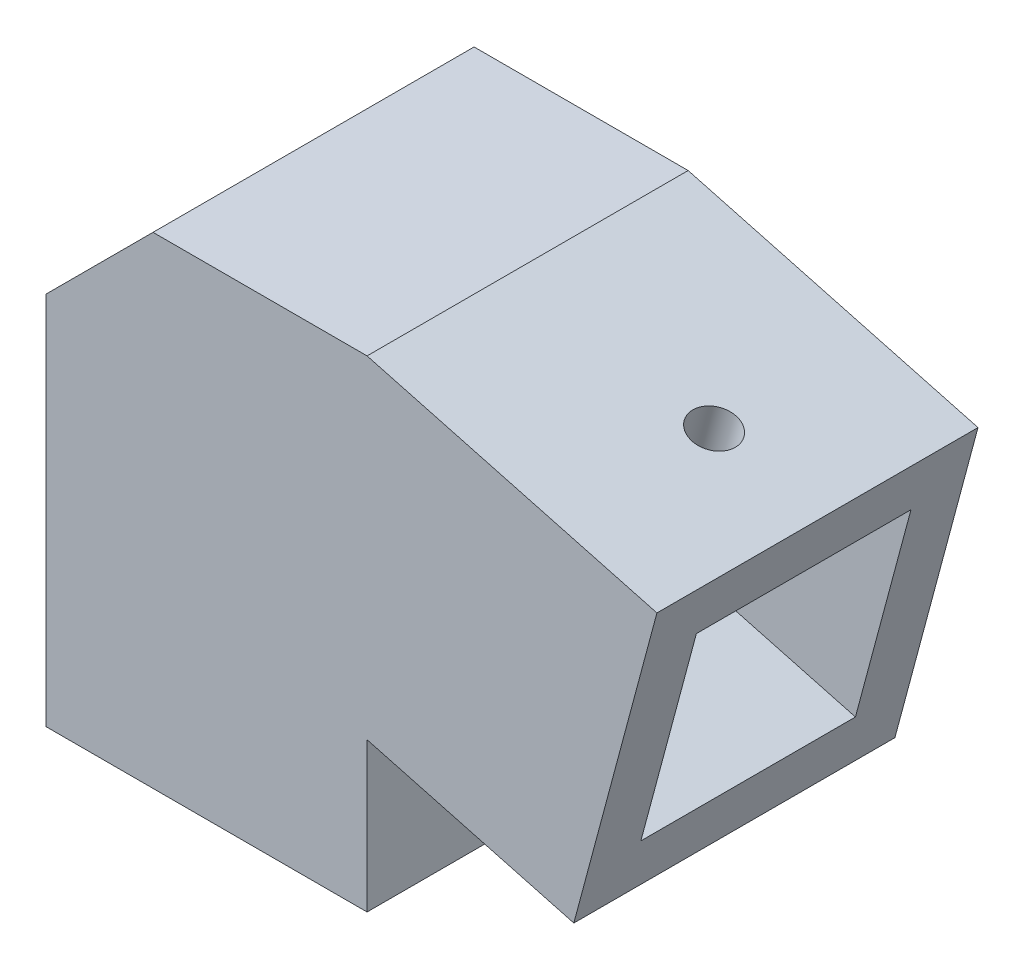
ISO-10303-21;
HEADER;
FILE_DESCRIPTION(('STEP AP214'),'2;1');
FILE_NAME('part.step','',(''),(''),'','','');
FILE_SCHEMA(('AUTOMOTIVE_DESIGN { 1 0 10303 214 1 1 1 1 }'));
ENDSEC;
DATA;
#1=APPLICATION_CONTEXT('core data for automotive mechanical design processes');
#2=APPLICATION_PROTOCOL_DEFINITION('international standard','automotive_design',2000,#1);
#3=PRODUCT_CONTEXT('',#1,'mechanical');
#4=PRODUCT('Part','Part','',(#3));
#5=PRODUCT_RELATED_PRODUCT_CATEGORY('part','',(#4));
#6=PRODUCT_DEFINITION_FORMATION('','',#4);
#7=PRODUCT_DEFINITION_CONTEXT('part definition',#1,'design');
#8=PRODUCT_DEFINITION('design','',#6,#7);
#9=PRODUCT_DEFINITION_SHAPE('','',#8);
#10=(LENGTH_UNIT() NAMED_UNIT(*) SI_UNIT(.MILLI.,.METRE.));
#11=(NAMED_UNIT(*) PLANE_ANGLE_UNIT() SI_UNIT($,.RADIAN.));
#12=(NAMED_UNIT(*) SI_UNIT($,.STERADIAN.) SOLID_ANGLE_UNIT());
#13=UNCERTAINTY_MEASURE_WITH_UNIT(LENGTH_MEASURE(1.E-05),#10,'distance_accuracy_value','');
#14=(GEOMETRIC_REPRESENTATION_CONTEXT(3) GLOBAL_UNCERTAINTY_ASSIGNED_CONTEXT((#13)) GLOBAL_UNIT_ASSIGNED_CONTEXT((#10,
#11,#12)) REPRESENTATION_CONTEXT('',''));
#15=CARTESIAN_POINT('',(0.,0.,0.));
#16=DIRECTION('',(0.,0.,1.));
#17=DIRECTION('',(1.,0.,0.));
#18=AXIS2_PLACEMENT_3D('',#15,#16,#17);
#19=CARTESIAN_POINT('',(15.,-25.,15.));
#20=DIRECTION('',(1.,0.,0.));
#21=DIRECTION('',(0.,0.,-1.));
#22=AXIS2_PLACEMENT_3D('',#19,#20,#21);
#23=PLANE('',#22);
#24=DIRECTION('',(0.,1.,0.));
#25=VECTOR('',#24,1.);
#26=CARTESIAN_POINT('',(15.,-25.,-15.));
#27=LINE('',#26,#25);
#28=CARTESIAN_POINT('',(15.,-25.,-15.));
#29=VERTEX_POINT('',#28);
#30=CARTESIAN_POINT('',(15.,-11.0582854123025,-15.));
#31=VERTEX_POINT('',#30);
#32=EDGE_CURVE('E321',#29,#31,#27,.T.);
#33=ORIENTED_EDGE('',*,*,#32,.T.);
#34=DIRECTION('',(0.,0.,1.));
#35=VECTOR('',#34,1.);
#36=CARTESIAN_POINT('',(15.,-11.0582854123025,-60.2376468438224));
#37=LINE('',#36,#35);
#38=CARTESIAN_POINT('',(15.,-11.0582854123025,15.));
#39=VERTEX_POINT('',#38);
#40=EDGE_CURVE('E284',#31,#39,#37,.T.);
#41=ORIENTED_EDGE('',*,*,#40,.T.);
#42=DIRECTION('',(0.,1.,0.));
#43=VECTOR('',#42,1.);
#44=CARTESIAN_POINT('',(15.,-25.,15.));
#45=LINE('',#44,#43);
#46=CARTESIAN_POINT('',(15.,-25.,15.));
#47=VERTEX_POINT('',#46);
#48=EDGE_CURVE('E325',#47,#39,#45,.T.);
#49=ORIENTED_EDGE('',*,*,#48,.F.);
#50=DIRECTION('',(0.,0.,-1.));
#51=VECTOR('',#50,1.);
#52=CARTESIAN_POINT('',(15.,-25.,15.));
#53=LINE('',#52,#51);
#54=EDGE_CURVE('E304',#47,#29,#53,.T.);
#55=ORIENTED_EDGE('',*,*,#54,.T.);
#56=EDGE_LOOP('',(#33,#41,#49,#55));
#57=FACE_BOUND('',#56,.T.);
#58=ADVANCED_FACE('F50',(#57),#23,.T.);
#59=CARTESIAN_POINT('',(-15.,-25.,15.));
#60=DIRECTION('',(0.,0.,1.));
#61=DIRECTION('',(1.,0.,0.));
#62=AXIS2_PLACEMENT_3D('',#59,#60,#61);
#63=PLANE('',#62);
#64=DIRECTION('',(1.,0.,0.));
#65=VECTOR('',#64,1.);
#66=CARTESIAN_POINT('',(-15.,20.,15.));
#67=LINE('',#66,#65);
#68=CARTESIAN_POINT('',(-4.99999999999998,20.,15.));
#69=VERTEX_POINT('',#68);
#70=CARTESIAN_POINT('',(15.,20.,15.));
#71=VERTEX_POINT('',#70);
#72=EDGE_CURVE('E305',#69,#71,#67,.T.);
#73=ORIENTED_EDGE('',*,*,#72,.F.);
#74=DIRECTION('',(-0.707106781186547,-0.707106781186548,0.));
#75=VECTOR('',#74,1.);
#76=CARTESIAN_POINT('',(-32.5,-7.50000000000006,15.));
#77=LINE('',#76,#75);
#78=CARTESIAN_POINT('',(-15.,9.99999999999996,15.));
#79=VERTEX_POINT('',#78);
#80=EDGE_CURVE('E71',#69,#79,#77,.T.);
#81=ORIENTED_EDGE('',*,*,#80,.T.);
#82=DIRECTION('',(0.,1.,0.));
#83=VECTOR('',#82,1.);
#84=CARTESIAN_POINT('',(-15.,-25.,15.));
#85=LINE('',#84,#83);
#86=CARTESIAN_POINT('',(-15.,-25.,15.));
#87=VERTEX_POINT('',#86);
#88=EDGE_CURVE('E326',#87,#79,#85,.T.);
#89=ORIENTED_EDGE('',*,*,#88,.F.);
#90=DIRECTION('',(1.,0.,0.));
#91=VECTOR('',#90,1.);
#92=CARTESIAN_POINT('',(-15.,-25.,15.));
#93=LINE('',#92,#91);
#94=EDGE_CURVE('E320',#87,#47,#93,.T.);
#95=ORIENTED_EDGE('',*,*,#94,.T.);
#96=ORIENTED_EDGE('',*,*,#48,.T.);
#97=DIRECTION('',(0.965925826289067,-0.258819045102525,0.));
#98=VECTOR('',#97,1.);
#99=CARTESIAN_POINT('',(15.,-11.0582854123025,15.));
#100=LINE('',#99,#98);
#101=CARTESIAN_POINT('',(34.3185165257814,-16.234666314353,15.));
#102=VERTEX_POINT('',#101);
#103=EDGE_CURVE('E255',#39,#102,#100,.T.);
#104=ORIENTED_EDGE('',*,*,#103,.T.);
#105=DIRECTION('',(0.258819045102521,0.965925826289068,0.));
#106=VECTOR('',#105,1.);
#107=CARTESIAN_POINT('',(34.3185165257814,-16.234666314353,15.));
#108=LINE('',#107,#106);
#109=CARTESIAN_POINT('',(42.083087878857,12.743108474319,15.));
#110=VERTEX_POINT('',#109);
#111=EDGE_CURVE('E270',#102,#110,#108,.T.);
#112=ORIENTED_EDGE('',*,*,#111,.T.);
#113=DIRECTION('',(-0.965925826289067,0.258819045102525,0.));
#114=VECTOR('',#113,1.);
#115=CARTESIAN_POINT('',(15.,20.,15.));
#116=LINE('',#115,#114);
#117=EDGE_CURVE('E261',#110,#71,#116,.T.);
#118=ORIENTED_EDGE('',*,*,#117,.T.);
#119=EDGE_LOOP('',(#73,#81,#89,#95,#96,#104,#112,#118));
#120=FACE_BOUND('',#119,.T.);
#121=ADVANCED_FACE('F350',(#120),#63,.T.);
#122=CARTESIAN_POINT('',(-15.,-25.,15.));
#123=DIRECTION('',(-1.,0.,0.));
#124=DIRECTION('',(0.,0.,1.));
#125=AXIS2_PLACEMENT_3D('',#122,#123,#124);
#126=PLANE('',#125);
#127=CARTESIAN_POINT('',(-15.,-15.,0.));
#128=DIRECTION('',(-1.,0.,0.));
#129=DIRECTION('',(0.,0.,1.));
#130=AXIS2_PLACEMENT_3D('',#127,#128,#129);
#131=CIRCLE('',#130,2.05);
#132=CARTESIAN_POINT('',(-15.,-15.,2.05));
#133=VERTEX_POINT('',#132);
#134=EDGE_CURVE('E437',#133,#133,#131,.T.);
#135=ORIENTED_EDGE('',*,*,#134,.F.);
#136=EDGE_LOOP('',(#135));
#137=FACE_BOUND('',#136,.T.);
#138=ORIENTED_EDGE('',*,*,#88,.T.);
#139=DIRECTION('',(0.,0.,-1.));
#140=VECTOR('',#139,1.);
#141=CARTESIAN_POINT('',(-15.,9.99999999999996,-15.));
#142=LINE('',#141,#140);
#143=CARTESIAN_POINT('',(-15.,9.99999999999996,-15.));
#144=VERTEX_POINT('',#143);
#145=EDGE_CURVE('E60',#79,#144,#142,.T.);
#146=ORIENTED_EDGE('',*,*,#145,.T.);
#147=DIRECTION('',(0.,1.,0.));
#148=VECTOR('',#147,1.);
#149=CARTESIAN_POINT('',(-15.,-25.,-15.));
#150=LINE('',#149,#148);
#151=CARTESIAN_POINT('',(-15.,-25.,-15.));
#152=VERTEX_POINT('',#151);
#153=EDGE_CURVE('E327',#152,#144,#150,.T.);
#154=ORIENTED_EDGE('',*,*,#153,.F.);
#155=DIRECTION('',(0.,0.,1.));
#156=VECTOR('',#155,1.);
#157=CARTESIAN_POINT('',(-15.,-25.,15.));
#158=LINE('',#157,#156);
#159=EDGE_CURVE('E312',#152,#87,#158,.T.);
#160=ORIENTED_EDGE('',*,*,#159,.T.);
#161=EDGE_LOOP('',(#138,#146,#154,#160));
#162=FACE_BOUND('',#161,.T.);
#163=ADVANCED_FACE('F372',(#137,#162),#126,.T.);
#164=CARTESIAN_POINT('',(-15.,-25.,-15.));
#165=DIRECTION('',(0.,0.,-1.));
#166=DIRECTION('',(-1.,0.,0.));
#167=AXIS2_PLACEMENT_3D('',#164,#165,#166);
#168=PLANE('',#167);
#169=ORIENTED_EDGE('',*,*,#153,.T.);
#170=DIRECTION('',(0.707106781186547,0.707106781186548,0.));
#171=VECTOR('',#170,1.);
#172=CARTESIAN_POINT('',(-32.5,-7.50000000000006,-15.));
#173=LINE('',#172,#171);
#174=CARTESIAN_POINT('',(-4.99999999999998,20.,-15.));
#175=VERTEX_POINT('',#174);
#176=EDGE_CURVE('E11',#144,#175,#173,.T.);
#177=ORIENTED_EDGE('',*,*,#176,.T.);
#178=DIRECTION('',(-1.,0.,0.));
#179=VECTOR('',#178,1.);
#180=CARTESIAN_POINT('',(-15.,20.,-15.));
#181=LINE('',#180,#179);
#182=CARTESIAN_POINT('',(15.,20.,-15.));
#183=VERTEX_POINT('',#182);
#184=EDGE_CURVE('E296',#183,#175,#181,.T.);
#185=ORIENTED_EDGE('',*,*,#184,.F.);
#186=DIRECTION('',(-0.965925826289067,0.258819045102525,0.));
#187=VECTOR('',#186,1.);
#188=CARTESIAN_POINT('',(15.,20.,-15.));
#189=LINE('',#188,#187);
#190=CARTESIAN_POINT('',(42.083087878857,12.743108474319,-15.));
#191=VERTEX_POINT('',#190);
#192=EDGE_CURVE('E277',#191,#183,#189,.T.);
#193=ORIENTED_EDGE('',*,*,#192,.F.);
#194=DIRECTION('',(0.258819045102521,0.965925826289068,0.));
#195=VECTOR('',#194,1.);
#196=CARTESIAN_POINT('',(34.3185165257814,-16.234666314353,-15.));
#197=LINE('',#196,#195);
#198=CARTESIAN_POINT('',(34.3185165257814,-16.234666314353,-15.));
#199=VERTEX_POINT('',#198);
#200=EDGE_CURVE('E285',#199,#191,#197,.T.);
#201=ORIENTED_EDGE('',*,*,#200,.F.);
#202=DIRECTION('',(0.965925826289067,-0.258819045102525,0.));
#203=VECTOR('',#202,1.);
#204=CARTESIAN_POINT('',(15.,-11.0582854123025,-15.));
#205=LINE('',#204,#203);
#206=EDGE_CURVE('E266',#31,#199,#205,.T.);
#207=ORIENTED_EDGE('',*,*,#206,.F.);
#208=ORIENTED_EDGE('',*,*,#32,.F.);
#209=DIRECTION('',(-1.,0.,0.));
#210=VECTOR('',#209,1.);
#211=CARTESIAN_POINT('',(-15.,-25.,-15.));
#212=LINE('',#211,#210);
#213=EDGE_CURVE('E307',#29,#152,#212,.T.);
#214=ORIENTED_EDGE('',*,*,#213,.T.);
#215=EDGE_LOOP('',(#169,#177,#185,#193,#201,#207,#208,#214));
#216=FACE_BOUND('',#215,.T.);
#217=ADVANCED_FACE('F354',(#216),#168,.T.);
#218=CARTESIAN_POINT('',(0.,-25.,0.));
#219=DIRECTION('',(0.,-1.,0.));
#220=DIRECTION('',(0.,0.,-1.));
#221=AXIS2_PLACEMENT_3D('',#218,#219,#220);
#222=PLANE('',#221);
#223=DIRECTION('',(0.,0.,1.));
#224=VECTOR('',#223,1.);
#225=CARTESIAN_POINT('',(10.025,-25.,-10.025));
#226=LINE('',#225,#224);
#227=CARTESIAN_POINT('',(10.025,-25.,-10.025));
#228=VERTEX_POINT('',#227);
#229=CARTESIAN_POINT('',(10.025,-25.,10.025));
#230=VERTEX_POINT('',#229);
#231=EDGE_CURVE('E215',#228,#230,#226,.T.);
#232=ORIENTED_EDGE('',*,*,#231,.F.);
#233=DIRECTION('',(1.,0.,0.));
#234=VECTOR('',#233,1.);
#235=CARTESIAN_POINT('',(-10.025,-25.,-10.025));
#236=LINE('',#235,#234);
#237=CARTESIAN_POINT('',(-10.025,-25.,-10.025));
#238=VERTEX_POINT('',#237);
#239=EDGE_CURVE('E222',#238,#228,#236,.T.);
#240=ORIENTED_EDGE('',*,*,#239,.F.);
#241=DIRECTION('',(0.,0.,-1.));
#242=VECTOR('',#241,1.);
#243=CARTESIAN_POINT('',(-10.025,-25.,-10.025));
#244=LINE('',#243,#242);
#245=CARTESIAN_POINT('',(-10.025,-25.,10.025));
#246=VERTEX_POINT('',#245);
#247=EDGE_CURVE('E245',#246,#238,#244,.T.);
#248=ORIENTED_EDGE('',*,*,#247,.F.);
#249=DIRECTION('',(-1.,0.,0.));
#250=VECTOR('',#249,1.);
#251=CARTESIAN_POINT('',(-10.025,-25.,10.025));
#252=LINE('',#251,#250);
#253=EDGE_CURVE('E238',#230,#246,#252,.T.);
#254=ORIENTED_EDGE('',*,*,#253,.F.);
#255=EDGE_LOOP('',(#232,#240,#248,#254));
#256=FACE_BOUND('',#255,.T.);
#257=ORIENTED_EDGE('',*,*,#54,.F.);
#258=ORIENTED_EDGE('',*,*,#94,.F.);
#259=ORIENTED_EDGE('',*,*,#159,.F.);
#260=ORIENTED_EDGE('',*,*,#213,.F.);
#261=EDGE_LOOP('',(#257,#258,#259,#260));
#262=FACE_BOUND('',#261,.T.);
#263=ADVANCED_FACE('F378',(#256,#262),#222,.T.);
#264=CARTESIAN_POINT('',(0.,20.,0.));
#265=DIRECTION('',(0.,-1.,0.));
#266=DIRECTION('',(0.,0.,-1.));
#267=AXIS2_PLACEMENT_3D('',#264,#265,#266);
#268=PLANE('',#267);
#269=ORIENTED_EDGE('',*,*,#184,.T.);
#270=DIRECTION('',(0.,0.,1.));
#271=VECTOR('',#270,1.);
#272=CARTESIAN_POINT('',(-4.99999999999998,20.,15.));
#273=LINE('',#272,#271);
#274=EDGE_CURVE('E329',#175,#69,#273,.T.);
#275=ORIENTED_EDGE('',*,*,#274,.T.);
#276=ORIENTED_EDGE('',*,*,#72,.T.);
#277=DIRECTION('',(0.,0.,-1.));
#278=VECTOR('',#277,1.);
#279=CARTESIAN_POINT('',(15.,20.,15.));
#280=LINE('',#279,#278);
#281=EDGE_CURVE('E295',#71,#183,#280,.T.);
#282=ORIENTED_EDGE('',*,*,#281,.T.);
#283=EDGE_LOOP('',(#269,#275,#276,#282));
#284=FACE_BOUND('',#283,.T.);
#285=ADVANCED_FACE('F342',(#284),#268,.F.);
#286=CARTESIAN_POINT('',(15.,-11.0582854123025,-60.2376468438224));
#287=DIRECTION('',(-0.258819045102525,-0.965925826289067,0.));
#288=DIRECTION('',(0.965925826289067,-0.258819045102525,0.));
#289=AXIS2_PLACEMENT_3D('',#286,#287,#288);
#290=PLANE('',#289);
#291=ORIENTED_EDGE('',*,*,#40,.F.);
#292=ORIENTED_EDGE('',*,*,#206,.T.);
#293=DIRECTION('',(0.,0.,1.));
#294=VECTOR('',#293,1.);
#295=CARTESIAN_POINT('',(34.3185165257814,-16.234666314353,-60.2376468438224));
#296=LINE('',#295,#294);
#297=EDGE_CURVE('E280',#199,#102,#296,.T.);
#298=ORIENTED_EDGE('',*,*,#297,.T.);
#299=ORIENTED_EDGE('',*,*,#103,.F.);
#300=EDGE_LOOP('',(#291,#292,#298,#299));
#301=FACE_BOUND('',#300,.T.);
#302=ADVANCED_FACE('F390',(#301),#290,.T.);
#303=CARTESIAN_POINT('',(34.3185165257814,-16.234666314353,-60.2376468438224));
#304=DIRECTION('',(0.965925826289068,-0.258819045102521,0.));
#305=DIRECTION('',(0.258819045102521,0.965925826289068,0.));
#306=AXIS2_PLACEMENT_3D('',#303,#304,#305);
#307=PLANE('',#306);
#308=DIRECTION('',(0.258819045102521,0.965925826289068,0.));
#309=VECTOR('',#308,1.);
#310=CARTESIAN_POINT('',(35.6061412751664,-11.4291853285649,-10.025));
#311=LINE('',#310,#309);
#312=CARTESIAN_POINT('',(35.6061412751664,-11.4291853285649,-10.025));
#313=VERTEX_POINT('',#312);
#314=CARTESIAN_POINT('',(40.7954631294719,7.93762748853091,-10.025));
#315=VERTEX_POINT('',#314);
#316=EDGE_CURVE('E170',#313,#315,#311,.T.);
#317=ORIENTED_EDGE('',*,*,#316,.F.);
#318=DIRECTION('',(0.,0.,-1.));
#319=VECTOR('',#318,1.);
#320=CARTESIAN_POINT('',(35.6061412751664,-11.4291853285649,10.025));
#321=LINE('',#320,#319);
#322=CARTESIAN_POINT('',(35.6061412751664,-11.4291853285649,10.025));
#323=VERTEX_POINT('',#322);
#324=EDGE_CURVE('E190',#323,#313,#321,.T.);
#325=ORIENTED_EDGE('',*,*,#324,.F.);
#326=DIRECTION('',(-0.258819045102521,-0.965925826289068,0.));
#327=VECTOR('',#326,1.);
#328=CARTESIAN_POINT('',(35.6061412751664,-11.4291853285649,10.025));
#329=LINE('',#328,#327);
#330=CARTESIAN_POINT('',(40.795463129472,7.93762748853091,10.025));
#331=VERTEX_POINT('',#330);
#332=EDGE_CURVE('E191',#331,#323,#329,.T.);
#333=ORIENTED_EDGE('',*,*,#332,.F.);
#334=DIRECTION('',(0.,0.,1.));
#335=VECTOR('',#334,1.);
#336=CARTESIAN_POINT('',(40.795463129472,7.93762748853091,10.025));
#337=LINE('',#336,#335);
#338=EDGE_CURVE('E202',#315,#331,#337,.T.);
#339=ORIENTED_EDGE('',*,*,#338,.F.);
#340=EDGE_LOOP('',(#317,#325,#333,#339));
#341=FACE_BOUND('',#340,.T.);
#342=ORIENTED_EDGE('',*,*,#297,.F.);
#343=ORIENTED_EDGE('',*,*,#200,.T.);
#344=DIRECTION('',(0.,0.,1.));
#345=VECTOR('',#344,1.);
#346=CARTESIAN_POINT('',(42.083087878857,12.743108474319,-60.2376468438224));
#347=LINE('',#346,#345);
#348=EDGE_CURVE('E281',#191,#110,#347,.T.);
#349=ORIENTED_EDGE('',*,*,#348,.T.);
#350=ORIENTED_EDGE('',*,*,#111,.F.);
#351=EDGE_LOOP('',(#342,#343,#349,#350));
#352=FACE_BOUND('',#351,.T.);
#353=ADVANCED_FACE('F388',(#341,#352),#307,.T.);
#354=CARTESIAN_POINT('',(15.,20.,-60.2376468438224));
#355=DIRECTION('',(0.258819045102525,0.965925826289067,0.));
#356=DIRECTION('',(-0.965925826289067,0.258819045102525,0.));
#357=AXIS2_PLACEMENT_3D('',#354,#355,#356);
#358=PLANE('',#357);
#359=CARTESIAN_POINT('',(32.4238296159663,15.3312989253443,0.));
#360=DIRECTION('',(0.258819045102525,0.965925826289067,0.));
#361=DIRECTION('',(-0.965925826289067,0.258819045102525,0.));
#362=AXIS2_PLACEMENT_3D('',#359,#360,#361);
#363=CIRCLE('',#362,2.05);
#364=CARTESIAN_POINT('',(30.4436816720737,15.8618779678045,0.));
#365=VERTEX_POINT('',#364);
#366=EDGE_CURVE('E442',#365,#365,#363,.T.);
#367=ORIENTED_EDGE('',*,*,#366,.F.);
#368=EDGE_LOOP('',(#367));
#369=FACE_BOUND('',#368,.T.);
#370=ORIENTED_EDGE('',*,*,#348,.F.);
#371=ORIENTED_EDGE('',*,*,#192,.T.);
#372=ORIENTED_EDGE('',*,*,#281,.F.);
#373=ORIENTED_EDGE('',*,*,#117,.F.);
#374=EDGE_LOOP('',(#370,#371,#372,#373));
#375=FACE_BOUND('',#374,.T.);
#376=ADVANCED_FACE('F352',(#369,#375),#358,.T.);
#377=CARTESIAN_POINT('',(10.025,-5.,-10.025));
#378=DIRECTION('',(1.,0.,0.));
#379=DIRECTION('',(0.,0.,-1.));
#380=AXIS2_PLACEMENT_3D('',#377,#378,#379);
#381=PLANE('',#380);
#382=ORIENTED_EDGE('',*,*,#231,.T.);
#383=DIRECTION('',(0.,-1.,0.));
#384=VECTOR('',#383,1.);
#385=CARTESIAN_POINT('',(10.025,-5.,10.025));
#386=LINE('',#385,#384);
#387=CARTESIAN_POINT('',(10.025,-5.,10.025));
#388=VERTEX_POINT('',#387);
#389=EDGE_CURVE('E232',#388,#230,#386,.T.);
#390=ORIENTED_EDGE('',*,*,#389,.F.);
#391=DIRECTION('',(0.,0.,1.));
#392=VECTOR('',#391,1.);
#393=CARTESIAN_POINT('',(10.025,-5.,-10.025));
#394=LINE('',#393,#392);
#395=CARTESIAN_POINT('',(10.025,-5.,-10.025));
#396=VERTEX_POINT('',#395);
#397=EDGE_CURVE('E220',#396,#388,#394,.T.);
#398=ORIENTED_EDGE('',*,*,#397,.F.);
#399=DIRECTION('',(0.,-1.,0.));
#400=VECTOR('',#399,1.);
#401=CARTESIAN_POINT('',(10.025,-5.,-10.025));
#402=LINE('',#401,#400);
#403=EDGE_CURVE('E248',#396,#228,#402,.T.);
#404=ORIENTED_EDGE('',*,*,#403,.T.);
#405=EDGE_LOOP('',(#382,#390,#398,#404));
#406=FACE_BOUND('',#405,.T.);
#407=ADVANCED_FACE('F392',(#406),#381,.F.);
#408=CARTESIAN_POINT('',(-10.025,-5.,-10.025));
#409=DIRECTION('',(0.,0.,-1.));
#410=DIRECTION('',(-1.,0.,0.));
#411=AXIS2_PLACEMENT_3D('',#408,#409,#410);
#412=PLANE('',#411);
#413=ORIENTED_EDGE('',*,*,#239,.T.);
#414=ORIENTED_EDGE('',*,*,#403,.F.);
#415=DIRECTION('',(1.,0.,0.));
#416=VECTOR('',#415,1.);
#417=CARTESIAN_POINT('',(-10.025,-5.,-10.025));
#418=LINE('',#417,#416);
#419=CARTESIAN_POINT('',(-10.025,-5.,-10.025));
#420=VERTEX_POINT('',#419);
#421=EDGE_CURVE('E233',#420,#396,#418,.T.);
#422=ORIENTED_EDGE('',*,*,#421,.F.);
#423=DIRECTION('',(0.,-1.,0.));
#424=VECTOR('',#423,1.);
#425=CARTESIAN_POINT('',(-10.025,-5.,-10.025));
#426=LINE('',#425,#424);
#427=EDGE_CURVE('E254',#420,#238,#426,.T.);
#428=ORIENTED_EDGE('',*,*,#427,.T.);
#429=EDGE_LOOP('',(#413,#414,#422,#428));
#430=FACE_BOUND('',#429,.T.);
#431=ADVANCED_FACE('F398',(#430),#412,.F.);
#432=CARTESIAN_POINT('',(-10.025,-5.,-10.025));
#433=DIRECTION('',(-1.,0.,0.));
#434=DIRECTION('',(0.,0.,1.));
#435=AXIS2_PLACEMENT_3D('',#432,#433,#434);
#436=PLANE('',#435);
#437=CARTESIAN_POINT('',(-10.025,-15.,0.));
#438=DIRECTION('',(-1.,0.,0.));
#439=DIRECTION('',(0.,0.,1.));
#440=AXIS2_PLACEMENT_3D('',#437,#438,#439);
#441=CIRCLE('',#440,2.05);
#442=CARTESIAN_POINT('',(-10.025,-15.,2.05));
#443=VERTEX_POINT('',#442);
#444=EDGE_CURVE('E436',#443,#443,#441,.F.);
#445=ORIENTED_EDGE('',*,*,#444,.F.);
#446=EDGE_LOOP('',(#445));
#447=FACE_BOUND('',#446,.T.);
#448=ORIENTED_EDGE('',*,*,#247,.T.);
#449=ORIENTED_EDGE('',*,*,#427,.F.);
#450=DIRECTION('',(0.,0.,-1.));
#451=VECTOR('',#450,1.);
#452=CARTESIAN_POINT('',(-10.025,-5.,-10.025));
#453=LINE('',#452,#451);
#454=CARTESIAN_POINT('',(-10.025,-5.,10.025));
#455=VERTEX_POINT('',#454);
#456=EDGE_CURVE('E227',#455,#420,#453,.T.);
#457=ORIENTED_EDGE('',*,*,#456,.F.);
#458=DIRECTION('',(0.,-1.,0.));
#459=VECTOR('',#458,1.);
#460=CARTESIAN_POINT('',(-10.025,-5.,10.025));
#461=LINE('',#460,#459);
#462=EDGE_CURVE('E256',#455,#246,#461,.T.);
#463=ORIENTED_EDGE('',*,*,#462,.T.);
#464=EDGE_LOOP('',(#448,#449,#457,#463));
#465=FACE_BOUND('',#464,.T.);
#466=ADVANCED_FACE('F403',(#447,#465),#436,.F.);
#467=CARTESIAN_POINT('',(-10.025,-5.,10.025));
#468=DIRECTION('',(0.,0.,1.));
#469=DIRECTION('',(1.,0.,0.));
#470=AXIS2_PLACEMENT_3D('',#467,#468,#469);
#471=PLANE('',#470);
#472=ORIENTED_EDGE('',*,*,#253,.T.);
#473=ORIENTED_EDGE('',*,*,#462,.F.);
#474=DIRECTION('',(-1.,0.,0.));
#475=VECTOR('',#474,1.);
#476=CARTESIAN_POINT('',(-10.025,-5.,10.025));
#477=LINE('',#476,#475);
#478=EDGE_CURVE('E225',#388,#455,#477,.T.);
#479=ORIENTED_EDGE('',*,*,#478,.F.);
#480=ORIENTED_EDGE('',*,*,#389,.T.);
#481=EDGE_LOOP('',(#472,#473,#479,#480));
#482=FACE_BOUND('',#481,.T.);
#483=ADVANCED_FACE('F402',(#482),#471,.F.);
#484=CARTESIAN_POINT('',(0.,-5.,0.));
#485=DIRECTION('',(0.,1.,0.));
#486=DIRECTION('',(0.,0.,1.));
#487=AXIS2_PLACEMENT_3D('',#484,#485,#486);
#488=PLANE('',#487);
#489=ORIENTED_EDGE('',*,*,#397,.T.);
#490=ORIENTED_EDGE('',*,*,#478,.T.);
#491=ORIENTED_EDGE('',*,*,#456,.T.);
#492=ORIENTED_EDGE('',*,*,#421,.T.);
#493=EDGE_LOOP('',(#489,#490,#491,#492));
#494=FACE_BOUND('',#493,.T.);
#495=ADVANCED_FACE('F404',(#494),#488,.F.);
#496=CARTESIAN_POINT('',(14.3557730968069,-5.73516633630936,-10.025));
#497=DIRECTION('',(0.,0.,-1.));
#498=DIRECTION('',(-1.,0.,0.));
#499=AXIS2_PLACEMENT_3D('',#496,#497,#498);
#500=PLANE('',#499);
#501=ORIENTED_EDGE('',*,*,#316,.T.);
#502=DIRECTION('',(0.965925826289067,-0.258819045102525,0.));
#503=VECTOR('',#502,1.);
#504=CARTESIAN_POINT('',(19.5450949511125,13.6316464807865,-10.025));
#505=LINE('',#504,#503);
#506=CARTESIAN_POINT('',(19.5450949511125,13.6316464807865,-10.025));
#507=VERTEX_POINT('',#506);
#508=EDGE_CURVE('E159',#507,#315,#505,.T.);
#509=ORIENTED_EDGE('',*,*,#508,.F.);
#510=DIRECTION('',(0.258819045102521,0.965925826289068,0.));
#511=VECTOR('',#510,1.);
#512=CARTESIAN_POINT('',(14.3557730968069,-5.73516633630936,-10.025));
#513=LINE('',#512,#511);
#514=CARTESIAN_POINT('',(14.3557730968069,-5.73516633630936,-10.025));
#515=VERTEX_POINT('',#514);
#516=EDGE_CURVE('E165',#515,#507,#513,.T.);
#517=ORIENTED_EDGE('',*,*,#516,.F.);
#518=DIRECTION('',(0.965925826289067,-0.258819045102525,0.));
#519=VECTOR('',#518,1.);
#520=CARTESIAN_POINT('',(14.3557730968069,-5.73516633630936,-10.025));
#521=LINE('',#520,#519);
#522=EDGE_CURVE('E209',#515,#313,#521,.T.);
#523=ORIENTED_EDGE('',*,*,#522,.T.);
#524=EDGE_LOOP('',(#501,#509,#517,#523));
#525=FACE_BOUND('',#524,.T.);
#526=ADVANCED_FACE('F162',(#525),#500,.F.);
#527=CARTESIAN_POINT('',(14.3557730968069,-5.73516633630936,10.025));
#528=DIRECTION('',(-0.258819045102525,-0.965925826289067,0.));
#529=DIRECTION('',(0.965925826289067,-0.258819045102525,0.));
#530=AXIS2_PLACEMENT_3D('',#527,#528,#529);
#531=PLANE('',#530);
#532=ORIENTED_EDGE('',*,*,#324,.T.);
#533=ORIENTED_EDGE('',*,*,#522,.F.);
#534=DIRECTION('',(0.,0.,-1.));
#535=VECTOR('',#534,1.);
#536=CARTESIAN_POINT('',(14.3557730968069,-5.73516633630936,10.025));
#537=LINE('',#536,#535);
#538=CARTESIAN_POINT('',(14.3557730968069,-5.73516633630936,10.025));
#539=VERTEX_POINT('',#538);
#540=EDGE_CURVE('E173',#539,#515,#537,.T.);
#541=ORIENTED_EDGE('',*,*,#540,.F.);
#542=DIRECTION('',(0.965925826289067,-0.258819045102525,0.));
#543=VECTOR('',#542,1.);
#544=CARTESIAN_POINT('',(14.3557730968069,-5.73516633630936,10.025));
#545=LINE('',#544,#543);
#546=EDGE_CURVE('E212',#539,#323,#545,.T.);
#547=ORIENTED_EDGE('',*,*,#546,.T.);
#548=EDGE_LOOP('',(#532,#533,#541,#547));
#549=FACE_BOUND('',#548,.T.);
#550=ADVANCED_FACE('F417',(#549),#531,.F.);
#551=CARTESIAN_POINT('',(14.3557730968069,-5.73516633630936,10.025));
#552=DIRECTION('',(0.,0.,1.));
#553=DIRECTION('',(1.,0.,0.));
#554=AXIS2_PLACEMENT_3D('',#551,#552,#553);
#555=PLANE('',#554);
#556=ORIENTED_EDGE('',*,*,#332,.T.);
#557=ORIENTED_EDGE('',*,*,#546,.F.);
#558=DIRECTION('',(-0.258819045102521,-0.965925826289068,0.));
#559=VECTOR('',#558,1.);
#560=CARTESIAN_POINT('',(14.3557730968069,-5.73516633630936,10.025));
#561=LINE('',#560,#559);
#562=CARTESIAN_POINT('',(19.5450949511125,13.6316464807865,10.025));
#563=VERTEX_POINT('',#562);
#564=EDGE_CURVE('E185',#563,#539,#561,.T.);
#565=ORIENTED_EDGE('',*,*,#564,.F.);
#566=DIRECTION('',(0.965925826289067,-0.258819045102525,0.));
#567=VECTOR('',#566,1.);
#568=CARTESIAN_POINT('',(19.5450949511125,13.6316464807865,10.025));
#569=LINE('',#568,#567);
#570=EDGE_CURVE('E175',#563,#331,#569,.T.);
#571=ORIENTED_EDGE('',*,*,#570,.T.);
#572=EDGE_LOOP('',(#556,#557,#565,#571));
#573=FACE_BOUND('',#572,.T.);
#574=ADVANCED_FACE('F423',(#573),#555,.F.);
#575=CARTESIAN_POINT('',(19.5450949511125,13.6316464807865,10.025));
#576=DIRECTION('',(0.258819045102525,0.965925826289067,0.));
#577=DIRECTION('',(-0.965925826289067,0.258819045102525,0.));
#578=AXIS2_PLACEMENT_3D('',#575,#576,#577);
#579=PLANE('',#578);
#580=CARTESIAN_POINT('',(31.1362048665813,10.5258179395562,0.));
#581=DIRECTION('',(0.258819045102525,0.965925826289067,0.));
#582=DIRECTION('',(-0.965925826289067,0.258819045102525,0.));
#583=AXIS2_PLACEMENT_3D('',#580,#581,#582);
#584=CIRCLE('',#583,2.05);
#585=CARTESIAN_POINT('',(29.1560569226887,11.0563969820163,0.));
#586=VERTEX_POINT('',#585);
#587=EDGE_CURVE('E193',#586,#586,#584,.F.);
#588=ORIENTED_EDGE('',*,*,#587,.F.);
#589=EDGE_LOOP('',(#588));
#590=FACE_BOUND('',#589,.T.);
#591=ORIENTED_EDGE('',*,*,#338,.T.);
#592=ORIENTED_EDGE('',*,*,#570,.F.);
#593=DIRECTION('',(0.,0.,1.));
#594=VECTOR('',#593,1.);
#595=CARTESIAN_POINT('',(19.5450949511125,13.6316464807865,10.025));
#596=LINE('',#595,#594);
#597=EDGE_CURVE('E176',#507,#563,#596,.T.);
#598=ORIENTED_EDGE('',*,*,#597,.F.);
#599=ORIENTED_EDGE('',*,*,#508,.T.);
#600=EDGE_LOOP('',(#591,#592,#598,#599));
#601=FACE_BOUND('',#600,.T.);
#602=ADVANCED_FACE('F180',(#590,#601),#579,.F.);
#603=CARTESIAN_POINT('',(14.8279102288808,-3.97312657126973,0.));
#604=DIRECTION('',(-0.965925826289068,0.258819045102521,0.));
#605=DIRECTION('',(-0.258819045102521,-0.965925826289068,0.));
#606=AXIS2_PLACEMENT_3D('',#603,#604,#605);
#607=PLANE('',#606);
#608=ORIENTED_EDGE('',*,*,#516,.T.);
#609=ORIENTED_EDGE('',*,*,#597,.T.);
#610=ORIENTED_EDGE('',*,*,#564,.T.);
#611=ORIENTED_EDGE('',*,*,#540,.T.);
#612=EDGE_LOOP('',(#608,#609,#610,#611));
#613=FACE_BOUND('',#612,.T.);
#614=ADVANCED_FACE('F183',(#613),#607,.F.);
#615=CARTESIAN_POINT('',(-4.99999999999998,20.,0.));
#616=DIRECTION('',(-0.707106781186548,0.707106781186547,0.));
#617=DIRECTION('',(0.,0.,-1.));
#618=AXIS2_PLACEMENT_3D('',#615,#616,#617);
#619=PLANE('',#618);
#620=ORIENTED_EDGE('',*,*,#176,.F.);
#621=ORIENTED_EDGE('',*,*,#145,.F.);
#622=ORIENTED_EDGE('',*,*,#80,.F.);
#623=ORIENTED_EDGE('',*,*,#274,.F.);
#624=EDGE_LOOP('',(#620,#621,#622,#623));
#625=FACE_BOUND('',#624,.T.);
#626=ADVANCED_FACE('F49',(#625),#619,.T.);
#627=CARTESIAN_POINT('',(29.635500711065,4.92511378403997,0.));
#628=DIRECTION('',(0.258819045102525,0.965925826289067,0.));
#629=DIRECTION('',(-0.965925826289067,0.258819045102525,0.));
#630=AXIS2_PLACEMENT_3D('',#627,#628,#629);
#631=CYLINDRICAL_SURFACE('',#630,2.05);
#632=ORIENTED_EDGE('',*,*,#587,.T.);
#633=EDGE_LOOP('',(#632));
#634=FACE_BOUND('',#633,.T.);
#635=ORIENTED_EDGE('',*,*,#366,.T.);
#636=EDGE_LOOP('',(#635));
#637=FACE_BOUND('',#636,.T.);
#638=ADVANCED_FACE('F357',(#634,#637),#631,.F.);
#639=CARTESIAN_POINT('',(-4.22672439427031,-15.,0.));
#640=DIRECTION('',(-1.,0.,0.));
#641=DIRECTION('',(0.,0.,1.));
#642=AXIS2_PLACEMENT_3D('',#639,#640,#641);
#643=CYLINDRICAL_SURFACE('',#642,2.05);
#644=ORIENTED_EDGE('',*,*,#444,.T.);
#645=EDGE_LOOP('',(#644));
#646=FACE_BOUND('',#645,.T.);
#647=ORIENTED_EDGE('',*,*,#134,.T.);
#648=EDGE_LOOP('',(#647));
#649=FACE_BOUND('',#648,.T.);
#650=ADVANCED_FACE('F361',(#646,#649),#643,.F.);
#651=CLOSED_SHELL('',(#58,#121,#163,#217,#263,#285,#302,#353,#376,#407,#431,#466,#483,#495,#526,
#550,#574,#602,#614,#626,#638,#650));
#652=MANIFOLD_SOLID_BREP('B2',#651);
#653=ADVANCED_BREP_SHAPE_REPRESENTATION('',(#18,#652),#14);
#654=SHAPE_DEFINITION_REPRESENTATION(#9,#653);
ENDSEC;
END-ISO-10303-21;
